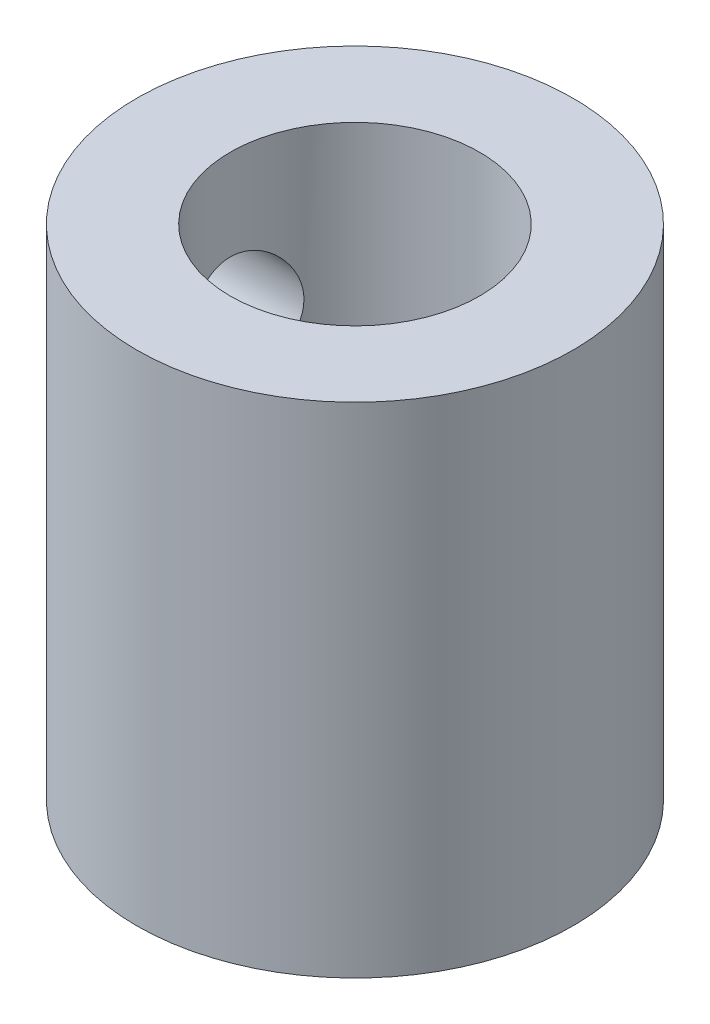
ISO-10303-21;
HEADER;
FILE_DESCRIPTION(('STEP AP214'),'2;1');
FILE_NAME('part.step','',(''),(''),'','','');
FILE_SCHEMA(('AUTOMOTIVE_DESIGN { 1 0 10303 214 1 1 1 1 }'));
ENDSEC;
DATA;
#1=APPLICATION_CONTEXT('core data for automotive mechanical design processes');
#2=APPLICATION_PROTOCOL_DEFINITION('international standard','automotive_design',2000,#1);
#3=PRODUCT_CONTEXT('',#1,'mechanical');
#4=PRODUCT('Part','Part','',(#3));
#5=PRODUCT_RELATED_PRODUCT_CATEGORY('part','',(#4));
#6=PRODUCT_DEFINITION_FORMATION('','',#4);
#7=PRODUCT_DEFINITION_CONTEXT('part definition',#1,'design');
#8=PRODUCT_DEFINITION('design','',#6,#7);
#9=PRODUCT_DEFINITION_SHAPE('','',#8);
#10=(LENGTH_UNIT() NAMED_UNIT(*) SI_UNIT(.MILLI.,.METRE.));
#11=(NAMED_UNIT(*) PLANE_ANGLE_UNIT() SI_UNIT($,.RADIAN.));
#12=(NAMED_UNIT(*) SI_UNIT($,.STERADIAN.) SOLID_ANGLE_UNIT());
#13=UNCERTAINTY_MEASURE_WITH_UNIT(LENGTH_MEASURE(1.E-05),#10,'distance_accuracy_value','');
#14=(GEOMETRIC_REPRESENTATION_CONTEXT(3) GLOBAL_UNCERTAINTY_ASSIGNED_CONTEXT((#13)) GLOBAL_UNIT_ASSIGNED_CONTEXT((#10,
#11,#12)) REPRESENTATION_CONTEXT('',''));
#15=CARTESIAN_POINT('',(0.,0.,0.));
#16=DIRECTION('',(0.,0.,1.));
#17=DIRECTION('',(1.,0.,0.));
#18=AXIS2_PLACEMENT_3D('',#15,#16,#17);
#19=CARTESIAN_POINT('',(0.,12.7,0.));
#20=DIRECTION('',(0.,-1.,0.));
#21=DIRECTION('',(0.,0.,-1.));
#22=AXIS2_PLACEMENT_3D('',#19,#20,#21);
#23=CYLINDRICAL_SURFACE('',#22,1.5875);
#24=CARTESIAN_POINT('',(0.,4.445,0.));
#25=DIRECTION('',(0.,1.,0.));
#26=DIRECTION('',(0.,0.,1.));
#27=AXIS2_PLACEMENT_3D('',#24,#25,#26);
#28=CIRCLE('',#27,1.5875);
#29=CARTESIAN_POINT('',(0.,4.445,1.5875));
#30=VERTEX_POINT('',#29);
#31=EDGE_CURVE('E54',#30,#30,#28,.T.);
#32=ORIENTED_EDGE('',*,*,#31,.T.);
#33=EDGE_LOOP('',(#32));
#34=FACE_BOUND('',#33,.T.);
#35=CARTESIAN_POINT('',(0.,3.556,0.));
#36=DIRECTION('',(0.,-1.,0.));
#37=DIRECTION('',(0.,0.,-1.));
#38=AXIS2_PLACEMENT_3D('',#35,#36,#37);
#39=CIRCLE('',#38,1.5875);
#40=CARTESIAN_POINT('',(0.,3.556,-1.5875));
#41=VERTEX_POINT('',#40);
#42=EDGE_CURVE('E62',#41,#41,#39,.T.);
#43=ORIENTED_EDGE('',*,*,#42,.T.);
#44=EDGE_LOOP('',(#43));
#45=FACE_BOUND('',#44,.T.);
#46=ADVANCED_FACE('F35',(#34,#45),#23,.F.);
#47=CARTESIAN_POINT('',(0.,12.7,0.));
#48=DIRECTION('',(0.,1.,0.));
#49=DIRECTION('',(0.,0.,1.));
#50=AXIS2_PLACEMENT_3D('',#47,#48,#49);
#51=PLANE('',#50);
#52=CARTESIAN_POINT('',(0.,12.7,0.));
#53=DIRECTION('',(0.,1.,0.));
#54=DIRECTION('',(0.,0.,1.));
#55=AXIS2_PLACEMENT_3D('',#52,#53,#54);
#56=CIRCLE('',#55,3.175);
#57=CARTESIAN_POINT('',(0.,12.7,3.175));
#58=VERTEX_POINT('',#57);
#59=EDGE_CURVE('E57',#58,#58,#56,.T.);
#60=ORIENTED_EDGE('',*,*,#59,.F.);
#61=EDGE_LOOP('',(#60));
#62=FACE_BOUND('',#61,.T.);
#63=CARTESIAN_POINT('',(0.,12.7,0.));
#64=DIRECTION('',(0.,1.,0.));
#65=DIRECTION('',(0.,0.,1.));
#66=AXIS2_PLACEMENT_3D('',#63,#64,#65);
#67=CIRCLE('',#66,5.55625);
#68=CARTESIAN_POINT('',(0.,12.7,5.55625));
#69=VERTEX_POINT('',#68);
#70=EDGE_CURVE('E10',#69,#69,#67,.T.);
#71=ORIENTED_EDGE('',*,*,#70,.T.);
#72=EDGE_LOOP('',(#71));
#73=FACE_BOUND('',#72,.T.);
#74=ADVANCED_FACE('F91',(#62,#73),#51,.T.);
#75=CARTESIAN_POINT('',(0.,0.,0.));
#76=DIRECTION('',(0.,1.,0.));
#77=DIRECTION('',(0.,0.,1.));
#78=AXIS2_PLACEMENT_3D('',#75,#76,#77);
#79=PLANE('',#78);
#80=CARTESIAN_POINT('',(0.,0.,0.));
#81=DIRECTION('',(0.,-1.,0.));
#82=DIRECTION('',(0.,0.,-1.));
#83=AXIS2_PLACEMENT_3D('',#80,#81,#82);
#84=CIRCLE('',#83,2.8575);
#85=CARTESIAN_POINT('',(0.,0.,-2.8575));
#86=VERTEX_POINT('',#85);
#87=EDGE_CURVE('E69',#86,#86,#84,.T.);
#88=ORIENTED_EDGE('',*,*,#87,.F.);
#89=EDGE_LOOP('',(#88));
#90=FACE_BOUND('',#89,.T.);
#91=CARTESIAN_POINT('',(0.,0.,0.));
#92=DIRECTION('',(0.,1.,0.));
#93=DIRECTION('',(0.,0.,1.));
#94=AXIS2_PLACEMENT_3D('',#91,#92,#93);
#95=CIRCLE('',#94,5.55625);
#96=CARTESIAN_POINT('',(0.,0.,5.55625));
#97=VERTEX_POINT('',#96);
#98=EDGE_CURVE('E49',#97,#97,#95,.T.);
#99=ORIENTED_EDGE('',*,*,#98,.F.);
#100=EDGE_LOOP('',(#99));
#101=FACE_BOUND('',#100,.T.);
#102=ADVANCED_FACE('F93',(#90,#101),#79,.F.);
#103=CARTESIAN_POINT('',(0.,12.7,0.));
#104=DIRECTION('',(0.,-1.,0.));
#105=DIRECTION('',(0.,0.,-1.));
#106=AXIS2_PLACEMENT_3D('',#103,#104,#105);
#107=CYLINDRICAL_SURFACE('',#106,5.55625);
#108=CARTESIAN_POINT('',(-5.55625,7.39,0.));
#109=CARTESIAN_POINT('',(-5.55624879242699,7.39000188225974,-0.0826529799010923));
#110=CARTESIAN_POINT('',(-5.55438761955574,7.39685439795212,-0.165325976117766));
#111=CARTESIAN_POINT('',(-5.54714387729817,7.424033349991,-0.328287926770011));
#112=CARTESIAN_POINT('',(-5.54175967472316,7.44436603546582,-0.408575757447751));
#113=CARTESIAN_POINT('',(-5.52806374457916,7.49779424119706,-0.564391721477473));
#114=CARTESIAN_POINT('',(-5.51975584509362,7.53087307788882,-0.639925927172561));
#115=CARTESIAN_POINT('',(-5.50108913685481,7.60879212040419,-0.784374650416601));
#116=CARTESIAN_POINT('',(-5.49073017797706,7.6536331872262,-0.853288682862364));
#117=CARTESIAN_POINT('',(-5.46880382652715,7.75492628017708,-0.984175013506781));
#118=CARTESIAN_POINT('',(-5.4572153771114,7.81160549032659,-1.04596796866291));
#119=CARTESIAN_POINT('',(-5.43427040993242,7.93448045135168,-1.1592970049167));
#120=CARTESIAN_POINT('',(-5.4229139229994,8.00067745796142,-1.21083173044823));
#121=CARTESIAN_POINT('',(-5.40150264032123,8.14214849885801,-1.30306231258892));
#122=CARTESIAN_POINT('',(-5.39147437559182,8.21756219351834,-1.34355067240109));
#123=CARTESIAN_POINT('',(-5.37416506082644,8.37444108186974,-1.41120227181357));
#124=CARTESIAN_POINT('',(-5.3668834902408,8.45590512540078,-1.43836803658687));
#125=CARTESIAN_POINT('',(-5.35610960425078,8.62058328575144,-1.47797820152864));
#126=CARTESIAN_POINT('',(-5.3525336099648,8.70371345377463,-1.49074829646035));
#127=CARTESIAN_POINT('',(-5.34932584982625,8.87100720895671,-1.50222019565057));
#128=CARTESIAN_POINT('',(-5.34969332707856,8.95517059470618,-1.5009246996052));
#129=CARTESIAN_POINT('',(-5.35425616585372,9.11958985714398,-1.4845604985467));
#130=CARTESIAN_POINT('',(-5.3583416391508,9.19988862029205,-1.46988716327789));
#131=CARTESIAN_POINT('',(-5.3697040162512,9.35683998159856,-1.42781756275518));
#132=CARTESIAN_POINT('',(-5.37698118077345,9.43349228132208,-1.40042025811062));
#133=CARTESIAN_POINT('',(-5.39400275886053,9.58199938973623,-1.33336123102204));
#134=CARTESIAN_POINT('',(-5.40377462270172,9.65378877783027,-1.29356189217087));
#135=CARTESIAN_POINT('',(-5.42466994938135,9.78980840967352,-1.20292451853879));
#136=CARTESIAN_POINT('',(-5.43579368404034,9.85403712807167,-1.15208426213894));
#137=CARTESIAN_POINT('',(-5.45859570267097,9.97536963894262,-1.03879210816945));
#138=CARTESIAN_POINT('',(-5.47028008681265,10.032163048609,-0.976008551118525));
#139=CARTESIAN_POINT('',(-5.49255341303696,10.134479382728,-0.841665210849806));
#140=CARTESIAN_POINT('',(-5.50314230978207,10.1800018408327,-0.770105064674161));
#141=CARTESIAN_POINT('',(-5.52209942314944,10.2586254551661,-0.619751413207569));
#142=CARTESIAN_POINT('',(-5.53045733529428,10.2916692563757,-0.540926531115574));
#143=CARTESIAN_POINT('',(-5.54393634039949,10.3439460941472,-0.378562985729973));
#144=CARTESIAN_POINT('',(-5.54905815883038,10.3631822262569,-0.295025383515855));
#145=CARTESIAN_POINT('',(-5.55537769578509,10.3868075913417,-0.128255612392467));
#146=CARTESIAN_POINT('',(-5.55668688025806,10.3916186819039,-0.0450873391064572));
#147=CARTESIAN_POINT('',(-5.55555472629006,10.3874240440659,0.120868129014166));
#148=CARTESIAN_POINT('',(-5.5531137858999,10.3784197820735,0.203655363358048));
#149=CARTESIAN_POINT('',(-5.54482774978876,10.3471956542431,0.364984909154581));
#150=CARTESIAN_POINT('',(-5.53904357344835,10.3252121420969,0.443576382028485));
#151=CARTESIAN_POINT('',(-5.52472821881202,10.2689289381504,0.595947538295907));
#152=CARTESIAN_POINT('',(-5.51619673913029,10.2346278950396,0.669726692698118));
#153=CARTESIAN_POINT('',(-5.49707321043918,10.1539079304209,0.81200995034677));
#154=CARTESIAN_POINT('',(-5.48644344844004,10.107260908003,0.880379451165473));
#155=CARTESIAN_POINT('',(-5.46435155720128,10.0034589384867,1.00846808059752));
#156=CARTESIAN_POINT('',(-5.45288925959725,9.94630186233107,1.0681854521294));
#157=CARTESIAN_POINT('',(-5.43001230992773,9.8211319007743,1.17906011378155));
#158=CARTESIAN_POINT('',(-5.41860864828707,9.75285259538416,1.22991946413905));
#159=CARTESIAN_POINT('',(-5.39750382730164,9.60848634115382,1.31946618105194));
#160=CARTESIAN_POINT('',(-5.38780259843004,9.53239971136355,1.35815404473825));
#161=CARTESIAN_POINT('',(-5.37131317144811,9.37494948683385,1.42196898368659));
#162=CARTESIAN_POINT('',(-5.3645083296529,9.2936192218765,1.44717375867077));
#163=CARTESIAN_POINT('',(-5.35458183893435,9.12765900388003,1.48348525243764));
#164=CARTESIAN_POINT('',(-5.35145922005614,9.04302992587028,1.49459568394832));
#165=CARTESIAN_POINT('',(-5.34933317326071,8.87592869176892,1.50218568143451));
#166=CARTESIAN_POINT('',(-5.35019475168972,8.79347970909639,1.49914470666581));
#167=CARTESIAN_POINT('',(-5.35562315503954,8.63031701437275,1.47963343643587));
#168=CARTESIAN_POINT('',(-5.36018988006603,8.54960325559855,1.46316350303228));
#169=CARTESIAN_POINT('',(-5.3724326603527,8.39282250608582,1.41754297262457));
#170=CARTESIAN_POINT('',(-5.38008318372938,8.31672312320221,1.38849635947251));
#171=CARTESIAN_POINT('',(-5.39763160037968,8.17041968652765,1.31862762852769));
#172=CARTESIAN_POINT('',(-5.40752985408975,8.10021658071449,1.27780362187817));
#173=CARTESIAN_POINT('',(-5.42883061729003,7.96541581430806,1.18409597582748));
#174=CARTESIAN_POINT('',(-5.44026943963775,7.90105051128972,1.13088630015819));
#175=CARTESIAN_POINT('',(-5.46316236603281,7.78200673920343,1.01453466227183));
#176=CARTESIAN_POINT('',(-5.47461647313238,7.72733064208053,0.951390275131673));
#177=CARTESIAN_POINT('',(-5.49655205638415,7.62802835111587,0.815278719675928));
#178=CARTESIAN_POINT('',(-5.50700645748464,7.58365084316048,0.742125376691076));
#179=CARTESIAN_POINT('',(-5.52546614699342,7.5078931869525,0.589116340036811));
#180=CARTESIAN_POINT('',(-5.53347296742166,7.47650490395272,0.509264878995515));
#181=CARTESIAN_POINT('',(-5.5451309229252,7.43159271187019,0.358120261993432));
#182=CARTESIAN_POINT('',(-5.54926982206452,7.41603221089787,0.287463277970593));
#183=CARTESIAN_POINT('',(-5.55482974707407,7.39523556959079,0.144542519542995));
#184=CARTESIAN_POINT('',(-5.55625105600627,7.38999835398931,0.0722789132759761));
#185=CARTESIAN_POINT('',(-5.55625,7.39,0.));
#186=B_SPLINE_CURVE_WITH_KNOTS('',3,(#108,#109,#110,#111,#112,#113,#114,#115,#116,#117,#118,
#119,#120,#121,#122,#123,#124,#125,#126,#127,#128,#129,#130,#131,#132,#133,#134,#135,#136,#137,
#138,#139,#140,#141,#142,#143,#144,#145,#146,#147,#148,#149,#150,#151,#152,#153,#154,#155,#156,
#157,#158,#159,#160,#161,#162,#163,#164,#165,#166,#167,#168,#169,#170,#171,#172,#173,#174,#175,
#176,#177,#178,#179,#180,#181,#182,#183,#184,#185),.UNSPECIFIED.,.T.,.F.,(4,2,2,2,2,2,2,2,2,2,2,
2,2,2,2,2,2,2,2,2,2,2,2,2,2,2,2,2,2,2,2,2,2,2,2,2,2,2,4),(0.,0.247693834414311,
0.495502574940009,0.742988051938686,0.990491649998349,1.24327254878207,1.49608682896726,
1.75336600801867,2.01059640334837,2.2618823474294,2.51312006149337,2.75716518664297,
3.0012302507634,3.24810623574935,3.49503194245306,3.75022138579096,4.00542138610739,
4.26178047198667,4.51808206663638,4.7668112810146,5.0155140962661,5.25982191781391,
5.50415654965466,5.75336568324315,6.00262535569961,6.25910267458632,6.51556951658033,
6.7705420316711,7.02544736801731,7.27178044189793,7.51810687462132,7.76243445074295,
8.00680123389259,8.25852417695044,8.51030865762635,8.76765512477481,9.02484017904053,
9.24146765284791,9.45807256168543),.UNSPECIFIED.);
#187=CARTESIAN_POINT('',(-5.55625,7.39,0.));
#188=VERTEX_POINT('',#187);
#189=EDGE_CURVE('E74',#188,#188,#186,.T.);
#190=ORIENTED_EDGE('',*,*,#189,.T.);
#191=EDGE_LOOP('',(#190));
#192=FACE_BOUND('',#191,.T.);
#193=ORIENTED_EDGE('',*,*,#70,.F.);
#194=EDGE_LOOP('',(#193));
#195=FACE_BOUND('',#194,.T.);
#196=ORIENTED_EDGE('',*,*,#98,.T.);
#197=EDGE_LOOP('',(#196));
#198=FACE_BOUND('',#197,.T.);
#199=ADVANCED_FACE('F37',(#192,#195,#198),#107,.T.);
#200=CARTESIAN_POINT('',(0.,4.445,0.));
#201=DIRECTION('',(0.,1.,0.));
#202=DIRECTION('',(0.,0.,1.));
#203=AXIS2_PLACEMENT_3D('',#200,#201,#202);
#204=CYLINDRICAL_SURFACE('',#203,3.175);
#205=CARTESIAN_POINT('',(-2.7983253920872,8.89,-1.5));
#206=CARTESIAN_POINT('',(-2.79833097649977,8.81118925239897,-1.49999523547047));
#207=CARTESIAN_POINT('',(-2.80170427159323,8.73226438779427,-1.49374832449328));
#208=CARTESIAN_POINT('',(-2.81472644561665,8.57678533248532,-1.4690554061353));
#209=CARTESIAN_POINT('',(-2.82438992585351,8.50023709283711,-1.45058101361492));
#210=CARTESIAN_POINT('',(-2.84863009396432,8.35204732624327,-1.40237253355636));
#211=CARTESIAN_POINT('',(-2.86318279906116,8.28038386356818,-1.37269332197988));
#212=CARTESIAN_POINT('',(-2.89552502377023,8.14307060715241,-1.30308399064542));
#213=CARTESIAN_POINT('',(-2.91331440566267,8.0774205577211,-1.26315430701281));
#214=CARTESIAN_POINT('',(-2.95172227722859,7.94867675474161,-1.1707430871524));
#215=CARTESIAN_POINT('',(-2.97245254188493,7.88612211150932,-1.11755658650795));
#216=CARTESIAN_POINT('',(-3.01349951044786,7.77040856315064,-1.00161259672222));
#217=CARTESIAN_POINT('',(-3.03381602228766,7.71725393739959,-0.938850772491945));
#218=CARTESIAN_POINT('',(-3.07317288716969,7.61881062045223,-0.801034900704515));
#219=CARTESIAN_POINT('',(-3.09206866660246,7.57416549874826,-0.725476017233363));
#220=CARTESIAN_POINT('',(-3.12503381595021,7.49846247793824,-0.566861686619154));
#221=CARTESIAN_POINT('',(-3.13910591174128,7.46739690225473,-0.483810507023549));
#222=CARTESIAN_POINT('',(-3.16003750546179,7.42180568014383,-0.318263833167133));
#223=CARTESIAN_POINT('',(-3.16730464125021,7.40634019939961,-0.23607983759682));
#224=CARTESIAN_POINT('',(-3.17531500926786,7.38931330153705,-0.0699854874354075));
#225=CARTESIAN_POINT('',(-3.17606171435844,7.38774448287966,0.0139239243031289));
#226=CARTESIAN_POINT('',(-3.1711569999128,7.39814689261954,0.17410404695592));
#227=CARTESIAN_POINT('',(-3.16599910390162,7.4090736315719,0.250460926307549));
#228=CARTESIAN_POINT('',(-3.15058713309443,7.44231548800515,0.400106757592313));
#229=CARTESIAN_POINT('',(-3.14033267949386,7.46463145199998,0.473395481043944));
#230=CARTESIAN_POINT('',(-3.11549383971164,7.5202181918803,0.61616215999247));
#231=CARTESIAN_POINT('',(-3.10084769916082,7.55364599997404,0.685567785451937));
#232=CARTESIAN_POINT('',(-3.06858481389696,7.63031903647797,0.817962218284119));
#233=CARTESIAN_POINT('',(-3.05096698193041,7.67356786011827,0.880948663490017));
#234=CARTESIAN_POINT('',(-3.01265189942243,7.77298223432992,1.00453666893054));
#235=CARTESIAN_POINT('',(-2.9918200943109,7.82994263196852,1.0644578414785));
#236=CARTESIAN_POINT('',(-2.95046283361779,7.95300294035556,1.17424124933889));
#237=CARTESIAN_POINT('',(-2.92993757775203,8.01910854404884,1.2240971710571));
#238=CARTESIAN_POINT('',(-2.89039711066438,8.16282786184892,1.31484174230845));
#239=CARTESIAN_POINT('',(-2.87151577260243,8.2408610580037,1.35512986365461));
#240=CARTESIAN_POINT('',(-2.83914834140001,8.40371625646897,1.42170562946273));
#241=CARTESIAN_POINT('',(-2.82565717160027,8.48853178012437,1.44800645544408));
#242=CARTESIAN_POINT('',(-2.80697974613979,8.6557462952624,1.48387059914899));
#243=CARTESIAN_POINT('',(-2.80124227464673,8.73784244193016,1.4945499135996));
#244=CARTESIAN_POINT('',(-2.79714234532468,8.90283645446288,1.50221328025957));
#245=CARTESIAN_POINT('',(-2.79877582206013,8.98573385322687,1.49920488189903));
#246=CARTESIAN_POINT('',(-2.80865284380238,9.14184110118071,1.4806017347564));
#247=CARTESIAN_POINT('',(-2.81627144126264,9.21523813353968,1.46619608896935));
#248=CARTESIAN_POINT('',(-2.83637948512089,9.35846363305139,1.42690562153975));
#249=CARTESIAN_POINT('',(-2.8488703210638,9.42829107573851,1.40201781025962));
#250=CARTESIAN_POINT('',(-2.87800314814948,9.56603580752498,1.34123245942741));
#251=CARTESIAN_POINT('',(-2.89481019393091,9.63371599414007,1.30487958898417));
#252=CARTESIAN_POINT('',(-2.93050507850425,9.76238982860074,1.22260967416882));
#253=CARTESIAN_POINT('',(-2.94939395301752,9.82338011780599,1.17668785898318));
#254=CARTESIAN_POINT('',(-2.98962533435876,9.94395122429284,1.07066250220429));
#255=CARTESIAN_POINT('',(-3.0110091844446,10.0026390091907,1.00955462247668));
#256=CARTESIAN_POINT('',(-3.05197816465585,10.1091662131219,0.877952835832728));
#257=CARTESIAN_POINT('',(-3.07156288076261,10.1570031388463,0.807456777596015));
#258=CARTESIAN_POINT('',(-3.10717258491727,10.241063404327,0.657374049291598));
#259=CARTESIAN_POINT('',(-3.12313361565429,10.2770824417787,0.577656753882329));
#260=CARTESIAN_POINT('',(-3.14922093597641,10.3348659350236,0.412327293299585));
#261=CARTESIAN_POINT('',(-3.15935178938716,10.3566415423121,0.326719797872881));
#262=CARTESIAN_POINT('',(-3.17197971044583,10.3836388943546,0.159896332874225));
#263=CARTESIAN_POINT('',(-3.17505233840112,10.3901101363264,0.0789253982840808));
#264=CARTESIAN_POINT('',(-3.17494636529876,10.3898871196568,-0.0829833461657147));
#265=CARTESIAN_POINT('',(-3.17176950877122,10.3831965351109,-0.163921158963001));
#266=CARTESIAN_POINT('',(-3.15985410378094,10.3577084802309,-0.318841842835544));
#267=CARTESIAN_POINT('',(-3.15142868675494,10.3395919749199,-0.392963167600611));
#268=CARTESIAN_POINT('',(-3.13010132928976,10.2926210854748,-0.537026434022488));
#269=CARTESIAN_POINT('',(-3.1171986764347,10.2637649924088,-0.606967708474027));
#270=CARTESIAN_POINT('',(-3.08738510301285,10.1947349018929,-0.744198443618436));
#271=CARTESIAN_POINT('',(-3.0703197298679,10.1541093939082,-0.811226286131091));
#272=CARTESIAN_POINT('',(-3.03405477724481,10.0632843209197,-0.937805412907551));
#273=CARTESIAN_POINT('',(-3.01485423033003,10.0130804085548,-0.997353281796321));
#274=CARTESIAN_POINT('',(-2.97425749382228,9.89928446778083,-1.11287613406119));
#275=CARTESIAN_POINT('',(-2.9528185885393,9.83489637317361,-1.16805442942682));
#276=CARTESIAN_POINT('',(-2.91171333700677,9.69731214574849,-1.26705651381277));
#277=CARTESIAN_POINT('',(-2.89204830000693,9.62410959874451,-1.31087196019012));
#278=CARTESIAN_POINT('',(-2.85663554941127,9.4692324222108,-1.3863737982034));
#279=CARTESIAN_POINT('',(-2.84095675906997,9.38743935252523,-1.41785130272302));
#280=CARTESIAN_POINT('',(-2.81635628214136,9.21881199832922,-1.4661232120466));
#281=CARTESIAN_POINT('',(-2.80741192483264,9.13199569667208,-1.48296690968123));
#282=CARTESIAN_POINT('',(-2.80116429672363,9.01869463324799,-1.49469268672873));
#283=CARTESIAN_POINT('',(-2.80010260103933,8.99301180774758,-1.49668048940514));
#284=CARTESIAN_POINT('',(-2.79868221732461,8.94155672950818,-1.49933495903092));
#285=CARTESIAN_POINT('',(-2.79832356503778,8.9157844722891,-1.50000155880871));
#286=CARTESIAN_POINT('',(-2.7983253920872,8.89,-1.5));
#287=B_SPLINE_CURVE_WITH_KNOTS('',3,(#205,#206,#207,#208,#209,#210,#211,#212,#213,#214,#215,
#216,#217,#218,#219,#220,#221,#222,#223,#224,#225,#226,#227,#228,#229,#230,#231,#232,#233,#234,
#235,#236,#237,#238,#239,#240,#241,#242,#243,#244,#245,#246,#247,#248,#249,#250,#251,#252,#253,
#254,#255,#256,#257,#258,#259,#260,#261,#262,#263,#264,#265,#266,#267,#268,#269,#270,#271,#272,
#273,#274,#275,#276,#277,#278,#279,#280,#281,#282,#283,#284,#285,#286),.UNSPECIFIED.,.T.,.F.,(4,
2,2,2,2,2,2,2,2,2,2,2,2,2,2,2,2,2,2,2,2,2,2,2,2,2,2,2,2,2,2,2,2,2,2,2,2,2,2,2,4),(0.,
0.236323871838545,0.473198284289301,0.708927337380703,0.944646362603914,1.19762429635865,
1.45071710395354,1.71864285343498,1.98641694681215,2.23687152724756,2.48719270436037,
2.7180281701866,2.94888079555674,3.1831453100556,3.41749572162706,3.67216706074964,
3.92699765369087,4.19506898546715,4.46288723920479,4.71043828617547,4.95785281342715,
5.18239796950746,5.40700721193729,5.64198832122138,5.87708686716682,6.13804637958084,
6.39906579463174,6.66438519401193,6.92949661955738,7.17207877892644,7.41459323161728,
7.64386670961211,7.87317668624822,8.11282240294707,8.35257714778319,8.61378861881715,
8.87519133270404,9.14084608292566,9.40560248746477,9.48291651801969,9.56023447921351),.UNSPECIFIED.);
#288=CARTESIAN_POINT('',(-2.7983253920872,8.89,-1.5));
#289=VERTEX_POINT('',#288);
#290=EDGE_CURVE('E40',#289,#289,#287,.T.);
#291=ORIENTED_EDGE('',*,*,#290,.T.);
#292=EDGE_LOOP('',(#291));
#293=FACE_BOUND('',#292,.T.);
#294=CARTESIAN_POINT('',(0.,4.445,0.));
#295=DIRECTION('',(0.,1.,0.));
#296=DIRECTION('',(0.,0.,1.));
#297=AXIS2_PLACEMENT_3D('',#294,#295,#296);
#298=CIRCLE('',#297,3.175);
#299=CARTESIAN_POINT('',(0.,4.445,3.175));
#300=VERTEX_POINT('',#299);
#301=EDGE_CURVE('E61',#300,#300,#298,.T.);
#302=ORIENTED_EDGE('',*,*,#301,.F.);
#303=EDGE_LOOP('',(#302));
#304=FACE_BOUND('',#303,.T.);
#305=ORIENTED_EDGE('',*,*,#59,.T.);
#306=EDGE_LOOP('',(#305));
#307=FACE_BOUND('',#306,.T.);
#308=ADVANCED_FACE('F85',(#293,#304,#307),#204,.F.);
#309=CARTESIAN_POINT('',(0.,4.445,0.));
#310=DIRECTION('',(0.,1.,0.));
#311=DIRECTION('',(0.,0.,1.));
#312=AXIS2_PLACEMENT_3D('',#309,#310,#311);
#313=PLANE('',#312);
#314=ORIENTED_EDGE('',*,*,#31,.F.);
#315=EDGE_LOOP('',(#314));
#316=FACE_BOUND('',#315,.T.);
#317=ORIENTED_EDGE('',*,*,#301,.T.);
#318=EDGE_LOOP('',(#317));
#319=FACE_BOUND('',#318,.T.);
#320=ADVANCED_FACE('F83',(#316,#319),#313,.T.);
#321=CARTESIAN_POINT('',(0.,3.556,0.));
#322=DIRECTION('',(0.,-1.,0.));
#323=DIRECTION('',(0.,0.,-1.));
#324=AXIS2_PLACEMENT_3D('',#321,#322,#323);
#325=CYLINDRICAL_SURFACE('',#324,2.8575);
#326=CARTESIAN_POINT('',(0.,3.556,0.));
#327=DIRECTION('',(0.,-1.,0.));
#328=DIRECTION('',(0.,0.,-1.));
#329=AXIS2_PLACEMENT_3D('',#326,#327,#328);
#330=CIRCLE('',#329,2.8575);
#331=CARTESIAN_POINT('',(0.,3.556,-2.8575));
#332=VERTEX_POINT('',#331);
#333=EDGE_CURVE('E64',#332,#332,#330,.T.);
#334=ORIENTED_EDGE('',*,*,#333,.F.);
#335=EDGE_LOOP('',(#334));
#336=FACE_BOUND('',#335,.T.);
#337=ORIENTED_EDGE('',*,*,#87,.T.);
#338=EDGE_LOOP('',(#337));
#339=FACE_BOUND('',#338,.T.);
#340=ADVANCED_FACE('F106',(#336,#339),#325,.F.);
#341=CARTESIAN_POINT('',(0.,3.556,0.));
#342=DIRECTION('',(0.,-1.,0.));
#343=DIRECTION('',(0.,0.,-1.));
#344=AXIS2_PLACEMENT_3D('',#341,#342,#343);
#345=PLANE('',#344);
#346=ORIENTED_EDGE('',*,*,#42,.F.);
#347=EDGE_LOOP('',(#346));
#348=FACE_BOUND('',#347,.T.);
#349=ORIENTED_EDGE('',*,*,#333,.T.);
#350=EDGE_LOOP('',(#349));
#351=FACE_BOUND('',#350,.T.);
#352=ADVANCED_FACE('F110',(#348,#351),#345,.T.);
#353=CARTESIAN_POINT('',(-5.55625,8.89,0.));
#354=DIRECTION('',(1.,0.,0.));
#355=DIRECTION('',(0.,0.,-1.));
#356=AXIS2_PLACEMENT_3D('',#353,#354,#355);
#357=CYLINDRICAL_SURFACE('',#356,1.5);
#358=ORIENTED_EDGE('',*,*,#290,.F.);
#359=EDGE_LOOP('',(#358));
#360=FACE_BOUND('',#359,.T.);
#361=ORIENTED_EDGE('',*,*,#189,.F.);
#362=EDGE_LOOP('',(#361));
#363=FACE_BOUND('',#362,.T.);
#364=ADVANCED_FACE('F113',(#360,#363),#357,.F.);
#365=CLOSED_SHELL('',(#46,#74,#102,#199,#308,#320,#340,#352,#364));
#366=MANIFOLD_SOLID_BREP('B2',#365);
#367=ADVANCED_BREP_SHAPE_REPRESENTATION('',(#18,#366),#14);
#368=SHAPE_DEFINITION_REPRESENTATION(#9,#367);
ENDSEC;
END-ISO-10303-21;
